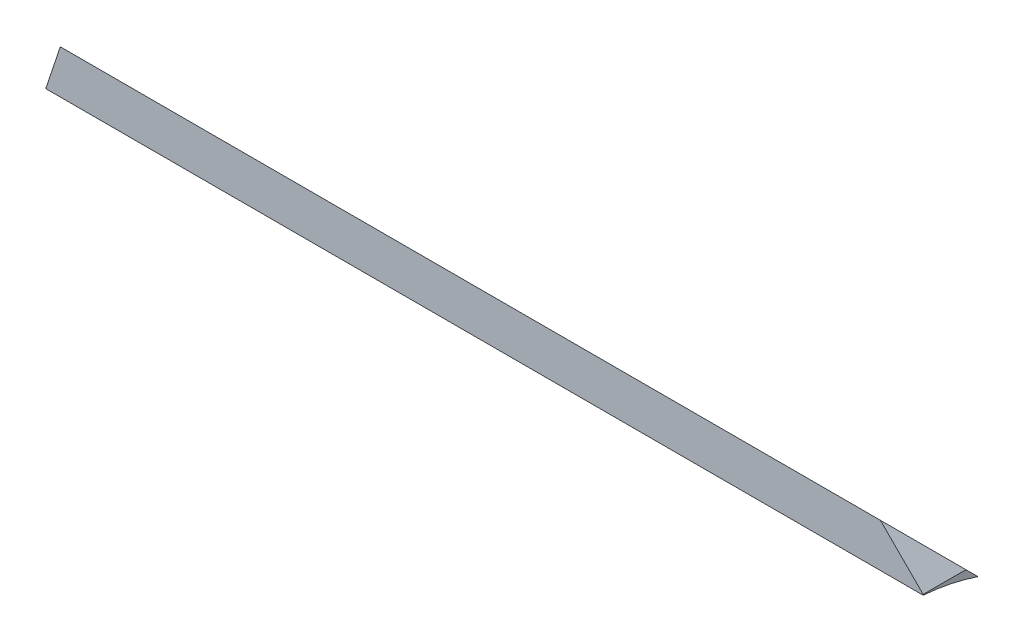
ISO-10303-21;
HEADER;
FILE_DESCRIPTION(('STEP AP214'),'2;1');
FILE_NAME('part.step','',(''),(''),'','','');
FILE_SCHEMA(('AUTOMOTIVE_DESIGN { 1 0 10303 214 1 1 1 1 }'));
ENDSEC;
DATA;
#1=APPLICATION_CONTEXT('core data for automotive mechanical design processes');
#2=APPLICATION_PROTOCOL_DEFINITION('international standard','automotive_design',2000,#1);
#3=PRODUCT_CONTEXT('',#1,'mechanical');
#4=PRODUCT('Part','Part','',(#3));
#5=PRODUCT_RELATED_PRODUCT_CATEGORY('part','',(#4));
#6=PRODUCT_DEFINITION_FORMATION('','',#4);
#7=PRODUCT_DEFINITION_CONTEXT('part definition',#1,'design');
#8=PRODUCT_DEFINITION('design','',#6,#7);
#9=PRODUCT_DEFINITION_SHAPE('','',#8);
#10=(LENGTH_UNIT() NAMED_UNIT(*) SI_UNIT(.MILLI.,.METRE.));
#11=(NAMED_UNIT(*) PLANE_ANGLE_UNIT() SI_UNIT($,.RADIAN.));
#12=(NAMED_UNIT(*) SI_UNIT($,.STERADIAN.) SOLID_ANGLE_UNIT());
#13=UNCERTAINTY_MEASURE_WITH_UNIT(LENGTH_MEASURE(1.E-05),#10,'distance_accuracy_value','');
#14=(GEOMETRIC_REPRESENTATION_CONTEXT(3) GLOBAL_UNCERTAINTY_ASSIGNED_CONTEXT((#13)) GLOBAL_UNIT_ASSIGNED_CONTEXT((#10,
#11,#12)) REPRESENTATION_CONTEXT('',''));
#15=CARTESIAN_POINT('',(0.,0.,0.));
#16=DIRECTION('',(0.,0.,1.));
#17=DIRECTION('',(1.,0.,0.));
#18=AXIS2_PLACEMENT_3D('',#15,#16,#17);
#19=CARTESIAN_POINT('',(0.,12.7,0.));
#20=DIRECTION('',(1.,0.,0.));
#21=DIRECTION('',(0.,0.,-1.));
#22=AXIS2_PLACEMENT_3D('',#19,#20,#21);
#23=PLANE('',#22);
#24=DIRECTION('',(0.,0.,1.));
#25=VECTOR('',#24,1.);
#26=CARTESIAN_POINT('',(0.,2.08686627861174,-12.7000000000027));
#27=LINE('',#26,#25);
#28=CARTESIAN_POINT('',(0.,2.08686627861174,-10.6131337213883));
#29=VERTEX_POINT('',#28);
#30=CARTESIAN_POINT('',(0.,2.08686627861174,-3.175));
#31=VERTEX_POINT('',#30);
#32=EDGE_CURVE('E53',#29,#31,#27,.T.);
#33=ORIENTED_EDGE('',*,*,#32,.F.);
#34=DIRECTION('',(0.,-0.707106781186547,-0.707106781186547));
#35=VECTOR('',#34,1.);
#36=CARTESIAN_POINT('',(0.,12.7,0.));
#37=LINE('',#36,#35);
#38=CARTESIAN_POINT('',(0.,-2.72872002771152E-12,-12.7000000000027));
#39=VERTEX_POINT('',#38);
#40=EDGE_CURVE('E86',#29,#39,#37,.T.);
#41=ORIENTED_EDGE('',*,*,#40,.T.);
#42=CARTESIAN_POINT('',(0.,-37.6006337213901,0.));
#43=DIRECTION('',(1.,0.,0.));
#44=DIRECTION('',(0.,0.,-1.));
#45=AXIS2_PLACEMENT_3D('',#42,#43,#44);
#46=CIRCLE('',#45,39.6875);
#47=CARTESIAN_POINT('',(0.,1.95966242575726,-3.175));
#48=VERTEX_POINT('',#47);
#49=EDGE_CURVE('E117',#39,#48,#46,.T.);
#50=ORIENTED_EDGE('',*,*,#49,.T.);
#51=DIRECTION('',(0.,1.,0.));
#52=VECTOR('',#51,1.);
#53=CARTESIAN_POINT('',(0.,19.3203936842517,-3.175));
#54=LINE('',#53,#52);
#55=EDGE_CURVE('E89',#48,#31,#54,.T.);
#56=ORIENTED_EDGE('',*,*,#55,.T.);
#57=EDGE_LOOP('',(#33,#41,#50,#56));
#58=FACE_BOUND('',#57,.T.);
#59=ADVANCED_FACE('F32',(#58),#23,.F.);
#60=CARTESIAN_POINT('',(152.4,12.7,0.));
#61=DIRECTION('',(-1.,0.,0.));
#62=DIRECTION('',(0.,0.,1.));
#63=AXIS2_PLACEMENT_3D('',#60,#61,#62);
#64=PLANE('',#63);
#65=DIRECTION('',(0.,0.,1.));
#66=VECTOR('',#65,1.);
#67=CARTESIAN_POINT('',(152.4,2.08686627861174,-12.7000000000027));
#68=LINE('',#67,#66);
#69=CARTESIAN_POINT('',(152.4,2.08686627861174,-10.6131337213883));
#70=VERTEX_POINT('',#69);
#71=CARTESIAN_POINT('',(152.4,2.08686627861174,-3.175));
#72=VERTEX_POINT('',#71);
#73=EDGE_CURVE('E90',#70,#72,#68,.T.);
#74=ORIENTED_EDGE('',*,*,#73,.T.);
#75=DIRECTION('',(0.,1.,0.));
#76=VECTOR('',#75,1.);
#77=CARTESIAN_POINT('',(152.4,19.3203936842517,-3.175));
#78=LINE('',#77,#76);
#79=CARTESIAN_POINT('',(152.4,1.95966242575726,-3.175));
#80=VERTEX_POINT('',#79);
#81=EDGE_CURVE('E113',#80,#72,#78,.T.);
#82=ORIENTED_EDGE('',*,*,#81,.F.);
#83=CARTESIAN_POINT('',(152.4,-37.6006337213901,0.));
#84=DIRECTION('',(1.,0.,0.));
#85=DIRECTION('',(0.,0.,-1.));
#86=AXIS2_PLACEMENT_3D('',#83,#84,#85);
#87=CIRCLE('',#86,39.6875);
#88=CARTESIAN_POINT('',(152.4,-2.72872002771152E-12,-12.7000000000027));
#89=VERTEX_POINT('',#88);
#90=EDGE_CURVE('E81',#89,#80,#87,.T.);
#91=ORIENTED_EDGE('',*,*,#90,.F.);
#92=DIRECTION('',(0.,-0.707106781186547,-0.707106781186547));
#93=VECTOR('',#92,1.);
#94=CARTESIAN_POINT('',(152.4,12.7,0.));
#95=LINE('',#94,#93);
#96=EDGE_CURVE('E96',#70,#89,#95,.T.);
#97=ORIENTED_EDGE('',*,*,#96,.F.);
#98=EDGE_LOOP('',(#74,#82,#91,#97));
#99=FACE_BOUND('',#98,.T.);
#100=ADVANCED_FACE('F111',(#99),#64,.F.);
#101=CARTESIAN_POINT('',(0.,12.7,0.));
#102=DIRECTION('',(0.,-0.707106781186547,0.707106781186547));
#103=DIRECTION('',(0.,-0.707106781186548,-0.707106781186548));
#104=AXIS2_PLACEMENT_3D('',#101,#102,#103);
#105=PLANE('',#104);
#106=DIRECTION('',(-0.229415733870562,-0.688247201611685,-0.688247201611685));
#107=VECTOR('',#106,1.);
#108=CARTESIAN_POINT('',(3.35151591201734,12.1414140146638,-0.558585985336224));
#109=LINE('',#108,#107);
#110=CARTESIAN_POINT('',(2.47937790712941,9.525,-3.175));
#111=VERTEX_POINT('',#110);
#112=EDGE_CURVE('E75',#111,#29,#109,.T.);
#113=ORIENTED_EDGE('',*,*,#112,.F.);
#114=DIRECTION('',(1.,0.,0.));
#115=VECTOR('',#114,1.);
#116=CARTESIAN_POINT('',(0.,9.525,-3.175));
#117=LINE('',#116,#115);
#118=CARTESIAN_POINT('',(144.961866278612,9.525,-3.175));
#119=VERTEX_POINT('',#118);
#120=EDGE_CURVE('E98',#111,#119,#117,.T.);
#121=ORIENTED_EDGE('',*,*,#120,.T.);
#122=DIRECTION('',(-0.577350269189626,0.577350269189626,0.577350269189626));
#123=VECTOR('',#122,1.);
#124=CARTESIAN_POINT('',(94.5245775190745,59.9622887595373,47.2622887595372));
#125=LINE('',#124,#123);
#126=EDGE_CURVE('E46',#70,#119,#125,.T.);
#127=ORIENTED_EDGE('',*,*,#126,.F.);
#128=ORIENTED_EDGE('',*,*,#96,.T.);
#129=DIRECTION('',(-1.,0.,0.));
#130=VECTOR('',#129,1.);
#131=CARTESIAN_POINT('',(0.,0.,-12.7));
#132=LINE('',#131,#130);
#133=EDGE_CURVE('E95',#89,#39,#132,.T.);
#134=ORIENTED_EDGE('',*,*,#133,.T.);
#135=ORIENTED_EDGE('',*,*,#40,.F.);
#136=EDGE_LOOP('',(#113,#121,#127,#128,#134,#135));
#137=FACE_BOUND('',#136,.T.);
#138=ADVANCED_FACE('F93',(#137),#105,.F.);
#139=CARTESIAN_POINT('',(0.,19.3203936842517,-3.175));
#140=DIRECTION('',(0.,0.,-1.));
#141=DIRECTION('',(0.,1.,0.));
#142=AXIS2_PLACEMENT_3D('',#139,#140,#141);
#143=PLANE('',#142);
#144=DIRECTION('',(0.316227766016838,0.948683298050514,0.));
#145=VECTOR('',#144,1.);
#146=CARTESIAN_POINT('',(5.17005822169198,17.5970409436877,-3.175));
#147=LINE('',#146,#145);
#148=EDGE_CURVE('E12',#31,#111,#147,.T.);
#149=ORIENTED_EDGE('',*,*,#148,.F.);
#150=ORIENTED_EDGE('',*,*,#55,.F.);
#151=DIRECTION('',(1.,0.,0.));
#152=VECTOR('',#151,1.);
#153=CARTESIAN_POINT('',(0.,1.95966242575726,-3.175));
#154=LINE('',#153,#152);
#155=EDGE_CURVE('E100',#48,#80,#154,.T.);
#156=ORIENTED_EDGE('',*,*,#155,.T.);
#157=ORIENTED_EDGE('',*,*,#81,.T.);
#158=DIRECTION('',(0.707106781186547,-0.707106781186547,0.));
#159=VECTOR('',#158,1.);
#160=CARTESIAN_POINT('',(67.58323629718,86.9036299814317,-3.17499999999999));
#161=LINE('',#160,#159);
#162=EDGE_CURVE('E39',#119,#72,#161,.T.);
#163=ORIENTED_EDGE('',*,*,#162,.F.);
#164=ORIENTED_EDGE('',*,*,#120,.F.);
#165=EDGE_LOOP('',(#149,#150,#156,#157,#163,#164));
#166=FACE_BOUND('',#165,.T.);
#167=ADVANCED_FACE('F116',(#166),#143,.F.);
#168=CARTESIAN_POINT('',(0.,-37.6006337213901,0.));
#169=DIRECTION('',(1.,0.,0.));
#170=DIRECTION('',(0.,0.,-1.));
#171=AXIS2_PLACEMENT_3D('',#168,#169,#170);
#172=CYLINDRICAL_SURFACE('',#171,39.6875);
#173=ORIENTED_EDGE('',*,*,#90,.T.);
#174=ORIENTED_EDGE('',*,*,#155,.F.);
#175=ORIENTED_EDGE('',*,*,#49,.F.);
#176=ORIENTED_EDGE('',*,*,#133,.F.);
#177=EDGE_LOOP('',(#173,#174,#175,#176));
#178=FACE_BOUND('',#177,.T.);
#179=ADVANCED_FACE('F124',(#178),#172,.F.);
#180=CARTESIAN_POINT('',(152.4,2.08686627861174,-12.7000000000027));
#181=DIRECTION('',(0.707106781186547,0.707106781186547,0.));
#182=DIRECTION('',(-0.707106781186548,0.707106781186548,0.));
#183=AXIS2_PLACEMENT_3D('',#180,#181,#182);
#184=PLANE('',#183);
#185=ORIENTED_EDGE('',*,*,#126,.T.);
#186=ORIENTED_EDGE('',*,*,#162,.T.);
#187=ORIENTED_EDGE('',*,*,#73,.F.);
#188=EDGE_LOOP('',(#185,#186,#187));
#189=FACE_BOUND('',#188,.T.);
#190=ADVANCED_FACE('F105',(#189),#184,.T.);
#191=CARTESIAN_POINT('',(25.4,78.2868662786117,-12.7000000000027));
#192=DIRECTION('',(-0.948683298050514,0.316227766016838,0.));
#193=DIRECTION('',(-0.316227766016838,-0.948683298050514,0.));
#194=AXIS2_PLACEMENT_3D('',#191,#192,#193);
#195=PLANE('',#194);
#196=ORIENTED_EDGE('',*,*,#112,.T.);
#197=ORIENTED_EDGE('',*,*,#32,.T.);
#198=ORIENTED_EDGE('',*,*,#148,.T.);
#199=EDGE_LOOP('',(#196,#197,#198));
#200=FACE_BOUND('',#199,.T.);
#201=ADVANCED_FACE('F76',(#200),#195,.T.);
#202=CLOSED_SHELL('',(#59,#100,#138,#167,#179,#190,#201));
#203=MANIFOLD_SOLID_BREP('B2',#202);
#204=ADVANCED_BREP_SHAPE_REPRESENTATION('',(#18,#203),#14);
#205=SHAPE_DEFINITION_REPRESENTATION(#9,#204);
ENDSEC;
END-ISO-10303-21;
